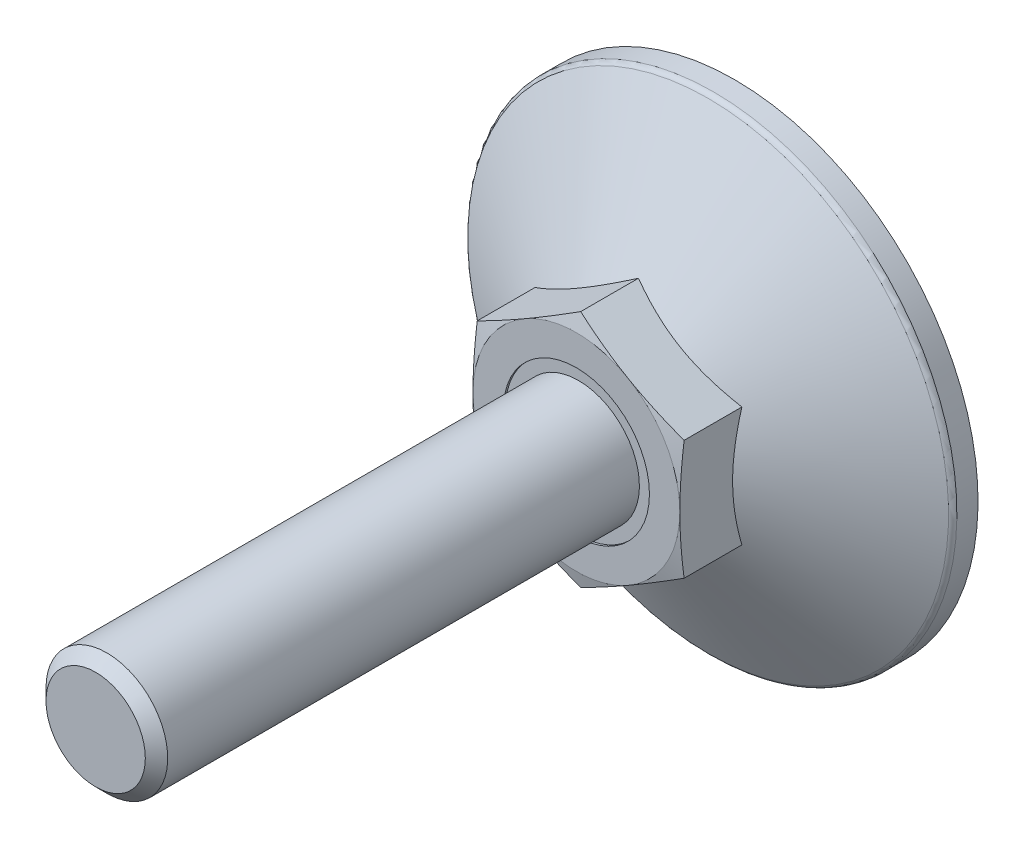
ISO-10303-21;
HEADER;
FILE_DESCRIPTION(('STEP AP214'),'2;1');
FILE_NAME('part.step','',(''),(''),'','','');
FILE_SCHEMA(('AUTOMOTIVE_DESIGN { 1 0 10303 214 1 1 1 1 }'));
ENDSEC;
DATA;
#1=APPLICATION_CONTEXT('core data for automotive mechanical design processes');
#2=APPLICATION_PROTOCOL_DEFINITION('international standard','automotive_design',2000,#1);
#3=PRODUCT_CONTEXT('',#1,'mechanical');
#4=PRODUCT('Part','Part','',(#3));
#5=PRODUCT_RELATED_PRODUCT_CATEGORY('part','',(#4));
#6=PRODUCT_DEFINITION_FORMATION('','',#4);
#7=PRODUCT_DEFINITION_CONTEXT('part definition',#1,'design');
#8=PRODUCT_DEFINITION('design','',#6,#7);
#9=PRODUCT_DEFINITION_SHAPE('','',#8);
#10=(LENGTH_UNIT() NAMED_UNIT(*) SI_UNIT(.MILLI.,.METRE.));
#11=(NAMED_UNIT(*) PLANE_ANGLE_UNIT() SI_UNIT($,.RADIAN.));
#12=(NAMED_UNIT(*) SI_UNIT($,.STERADIAN.) SOLID_ANGLE_UNIT());
#13=UNCERTAINTY_MEASURE_WITH_UNIT(LENGTH_MEASURE(1.E-05),#10,'distance_accuracy_value','');
#14=(GEOMETRIC_REPRESENTATION_CONTEXT(3) GLOBAL_UNCERTAINTY_ASSIGNED_CONTEXT((#13)) GLOBAL_UNIT_ASSIGNED_CONTEXT((#10,
#11,#12)) REPRESENTATION_CONTEXT('',''));
#15=CARTESIAN_POINT('',(0.,0.,0.));
#16=DIRECTION('',(0.,0.,1.));
#17=DIRECTION('',(1.,0.,0.));
#18=AXIS2_PLACEMENT_3D('',#15,#16,#17);
#19=CARTESIAN_POINT('',(0.,9.8149545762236,27.));
#20=DIRECTION('',(0.5,-0.86602540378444,0.));
#21=DIRECTION('',(0.86602540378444,0.5,0.));
#22=AXIS2_PLACEMENT_3D('',#19,#20,#21);
#23=PLANE('',#22);
#24=CARTESIAN_POINT('',(0.000200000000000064,9.81507004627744,12.6476280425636));
#25=CARTESIAN_POINT('',(-0.352800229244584,9.61126526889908,12.7022599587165));
#26=CARTESIAN_POINT('',(-0.706440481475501,9.40709097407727,12.7518566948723));
#27=CARTESIAN_POINT('',(-1.41496987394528,8.99802133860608,12.8389934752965));
#28=CARTESIAN_POINT('',(-1.76985946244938,8.79312573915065,12.8765286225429));
#29=CARTESIAN_POINT('',(-2.47873586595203,8.38385575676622,12.9373509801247));
#30=CARTESIAN_POINT('',(-2.83271788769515,8.17948414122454,12.9607107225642));
#31=CARTESIAN_POINT('',(-3.5411333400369,7.77048028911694,12.9920337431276));
#32=CARTESIAN_POINT('',(-3.89556667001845,7.56584811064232,13.));
#33=CARTESIAN_POINT('',(-4.60443332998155,7.15658375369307,13.));
#34=CARTESIAN_POINT('',(-4.9588666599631,6.95195157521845,12.9920337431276));
#35=CARTESIAN_POINT('',(-5.66728211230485,6.54294772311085,12.9607107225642));
#36=CARTESIAN_POINT('',(-6.02126413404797,6.33857610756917,12.9373509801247));
#37=CARTESIAN_POINT('',(-6.73014053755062,5.92930612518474,12.8765286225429));
#38=CARTESIAN_POINT('',(-7.08503012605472,5.7244105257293,12.8389934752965));
#39=CARTESIAN_POINT('',(-7.7935595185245,5.31534089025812,12.7518566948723));
#40=CARTESIAN_POINT('',(-8.14719977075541,5.11116659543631,12.7022599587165));
#41=CARTESIAN_POINT('',(-8.5002,4.90736181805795,12.6476280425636));
#42=B_SPLINE_CURVE_WITH_KNOTS('',3,(#24,#25,#26,#27,#28,#29,#30,#31,#32,#33,#34,#35,#36,#37,#38,
#39,#40,#41),.UNSPECIFIED.,.F.,.F.,(4,2,2,2,2,2,2,2,4),(0.,1.23382789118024,2.46815608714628,
3.69611406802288,4.92383440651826,6.15155474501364,7.37951272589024,8.61384092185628,
9.84766881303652),.UNSPECIFIED.);
#43=CARTESIAN_POINT('',(0.,9.8149545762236,12.6476589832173));
#44=VERTEX_POINT('',#43);
#45=CARTESIAN_POINT('',(-4.25,7.36121593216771,13.));
#46=VERTEX_POINT('',#45);
#47=EDGE_CURVE('E269',#44,#46,#42,.T.);
#48=ORIENTED_EDGE('',*,*,#47,.F.);
#49=DIRECTION('',(0.,0.,-1.));
#50=VECTOR('',#49,1.);
#51=CARTESIAN_POINT('',(0.,9.8149545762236,27.));
#52=LINE('',#51,#50);
#53=CARTESIAN_POINT('',(0.,9.8149545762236,7.90533871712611));
#54=VERTEX_POINT('',#53);
#55=EDGE_CURVE('E43',#44,#54,#52,.T.);
#56=ORIENTED_EDGE('',*,*,#55,.T.);
#57=CARTESIAN_POINT('',(-8.5002,4.90736181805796,7.90527204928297));
#58=CARTESIAN_POINT('',(-8.31336077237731,5.0152334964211,7.96754195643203));
#59=CARTESIAN_POINT('',(-8.1258249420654,5.12350735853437,8.02698579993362));
#60=CARTESIAN_POINT('',(-7.74923024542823,5.34093440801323,8.13944298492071));
#61=CARTESIAN_POINT('',(-7.56017075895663,5.45008795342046,8.19245355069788));
#62=CARTESIAN_POINT('',(-6.98996524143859,5.77929626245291,8.34079470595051));
#63=CARTESIAN_POINT('',(-6.60656835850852,6.00065055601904,8.42516916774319));
#64=CARTESIAN_POINT('',(-6.03282233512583,6.33190297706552,8.52410807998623));
#65=CARTESIAN_POINT('',(-5.8441872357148,6.44081150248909,8.55229289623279));
#66=CARTESIAN_POINT('',(-5.46606397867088,6.65912106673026,8.59955401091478));
#67=CARTESIAN_POINT('',(-5.27657589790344,6.76852206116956,8.61863111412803));
#68=CARTESIAN_POINT('',(-4.89727347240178,6.98751241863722,8.64719332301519));
#69=CARTESIAN_POINT('',(-4.70745974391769,7.0971014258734,8.65668931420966));
#70=CARTESIAN_POINT('',(-4.3276569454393,7.31638067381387,8.66588571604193));
#71=CARTESIAN_POINT('',(-4.13766788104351,7.42607091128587,8.66558642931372));
#72=CARTESIAN_POINT('',(-3.78247698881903,7.63114046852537,8.65587362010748));
#73=CARTESIAN_POINT('',(-3.61725009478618,7.7265342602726,8.64764492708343));
#74=CARTESIAN_POINT('',(-3.28718328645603,7.91709842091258,8.62393885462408));
#75=CARTESIAN_POINT('',(-3.12234339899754,8.01226877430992,8.60846098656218));
#76=CARTESIAN_POINT('',(-2.62846189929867,8.29741139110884,8.55151947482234));
#77=CARTESIAN_POINT('',(-2.30029449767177,8.48687892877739,8.49955503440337));
#78=CARTESIAN_POINT('',(-1.64047857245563,8.86782383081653,8.36964315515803));
#79=CARTESIAN_POINT('',(-1.30891425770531,9.0592525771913,8.29114502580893));
#80=CARTESIAN_POINT('',(-0.650730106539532,9.43925537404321,8.11298675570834));
#81=CARTESIAN_POINT('',(-0.324101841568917,9.62783429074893,8.01336845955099));
#82=CARTESIAN_POINT('',(0.000199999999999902,9.81507004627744,7.90527204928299));
#83=B_SPLINE_CURVE_WITH_KNOTS('',3,(#57,#58,#59,#60,#61,#62,#63,#64,#65,#66,#67,#68,#69,#70,#71,
#72,#73,#74,#75,#76,#77,#78,#79,#80,#81,#82),.UNSPECIFIED.,.F.,.F.,(4,2,2,2,2,2,2,2,2,2,2,2,4),
(0.,0.673596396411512,1.34748239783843,2.69805431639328,3.35679995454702,4.01548737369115,
4.67342558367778,5.33134346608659,5.90409556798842,6.47688628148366,7.62328361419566,
8.79510569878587,9.96462743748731),.UNSPECIFIED.);
#84=CARTESIAN_POINT('',(-8.5,4.9074772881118,7.90533871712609));
#85=VERTEX_POINT('',#84);
#86=EDGE_CURVE('E237',#85,#54,#83,.T.);
#87=ORIENTED_EDGE('',*,*,#86,.F.);
#88=DIRECTION('',(0.,0.,-1.));
#89=VECTOR('',#88,1.);
#90=CARTESIAN_POINT('',(-8.5,4.9074772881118,27.));
#91=LINE('',#90,#89);
#92=CARTESIAN_POINT('',(-8.5,4.9074772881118,12.6476589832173));
#93=VERTEX_POINT('',#92);
#94=EDGE_CURVE('E282',#93,#85,#91,.T.);
#95=ORIENTED_EDGE('',*,*,#94,.F.);
#96=EDGE_CURVE('E169',#46,#93,#42,.T.);
#97=ORIENTED_EDGE('',*,*,#96,.F.);
#98=EDGE_LOOP('',(#48,#56,#87,#95,#97));
#99=FACE_BOUND('',#98,.T.);
#100=ADVANCED_FACE('F14',(#99),#23,.F.);
#101=CARTESIAN_POINT('',(8.5,4.9074772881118,27.));
#102=DIRECTION('',(-0.5,-0.86602540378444,0.));
#103=DIRECTION('',(0.86602540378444,-0.5,0.));
#104=AXIS2_PLACEMENT_3D('',#101,#102,#103);
#105=PLANE('',#104);
#106=CARTESIAN_POINT('',(8.5002,4.90736181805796,12.6476280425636));
#107=CARTESIAN_POINT('',(8.14719977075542,5.11116659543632,12.7022599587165));
#108=CARTESIAN_POINT('',(7.7935595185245,5.31534089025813,12.7518566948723));
#109=CARTESIAN_POINT('',(7.08503012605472,5.72441052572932,12.8389934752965));
#110=CARTESIAN_POINT('',(6.73014053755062,5.92930612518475,12.8765286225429));
#111=CARTESIAN_POINT('',(6.02126413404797,6.33857610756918,12.9373509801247));
#112=CARTESIAN_POINT('',(5.66728211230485,6.54294772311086,12.9607107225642));
#113=CARTESIAN_POINT('',(4.9588666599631,6.95195157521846,12.9920337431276));
#114=CARTESIAN_POINT('',(4.60443332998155,7.15658375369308,13.));
#115=CARTESIAN_POINT('',(3.89556667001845,7.56584811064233,13.));
#116=CARTESIAN_POINT('',(3.5411333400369,7.77048028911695,12.9920337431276));
#117=CARTESIAN_POINT('',(2.83271788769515,8.17948414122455,12.9607107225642));
#118=CARTESIAN_POINT('',(2.47873586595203,8.38385575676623,12.9373509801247));
#119=CARTESIAN_POINT('',(1.76985946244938,8.79312573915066,12.8765286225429));
#120=CARTESIAN_POINT('',(1.41496987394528,8.9980213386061,12.8389934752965));
#121=CARTESIAN_POINT('',(0.706440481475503,9.40709097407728,12.7518566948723));
#122=CARTESIAN_POINT('',(0.352800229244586,9.61126526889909,12.7022599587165));
#123=CARTESIAN_POINT('',(-0.000200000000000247,9.81507004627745,12.6476280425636));
#124=B_SPLINE_CURVE_WITH_KNOTS('',3,(#106,#107,#108,#109,#110,#111,#112,#113,#114,#115,#116,
#117,#118,#119,#120,#121,#122,#123),.UNSPECIFIED.,.F.,.F.,(4,2,2,2,2,2,2,2,4),(0.,
1.23382789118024,2.46815608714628,3.69611406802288,4.92383440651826,6.15155474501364,
7.37951272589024,8.61384092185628,9.84766881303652),.UNSPECIFIED.);
#125=CARTESIAN_POINT('',(8.5,4.9074772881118,12.6476589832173));
#126=VERTEX_POINT('',#125);
#127=CARTESIAN_POINT('',(4.25,7.36121593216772,13.));
#128=VERTEX_POINT('',#127);
#129=EDGE_CURVE('E121',#126,#128,#124,.T.);
#130=ORIENTED_EDGE('',*,*,#129,.F.);
#131=DIRECTION('',(0.,0.,-1.));
#132=VECTOR('',#131,1.);
#133=CARTESIAN_POINT('',(8.5,4.9074772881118,27.));
#134=LINE('',#133,#132);
#135=CARTESIAN_POINT('',(8.5,4.9074772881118,7.90533871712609));
#136=VERTEX_POINT('',#135);
#137=EDGE_CURVE('E128',#126,#136,#134,.T.);
#138=ORIENTED_EDGE('',*,*,#137,.T.);
#139=CARTESIAN_POINT('',(-0.0002,9.81507004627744,7.90527204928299));
#140=CARTESIAN_POINT('',(0.186639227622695,9.7071983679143,7.96754195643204));
#141=CARTESIAN_POINT('',(0.374175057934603,9.59892450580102,8.02698579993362));
#142=CARTESIAN_POINT('',(0.750769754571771,9.38149745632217,8.13944298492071));
#143=CARTESIAN_POINT('',(0.939829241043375,9.27234391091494,8.19245355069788));
#144=CARTESIAN_POINT('',(1.51003475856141,8.94313560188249,8.34079470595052));
#145=CARTESIAN_POINT('',(1.89343164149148,8.72178130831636,8.42516916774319));
#146=CARTESIAN_POINT('',(2.46717766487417,8.39052888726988,8.52410807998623));
#147=CARTESIAN_POINT('',(2.6558127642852,8.28162036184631,8.55229289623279));
#148=CARTESIAN_POINT('',(3.03393602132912,8.06331079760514,8.59955401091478));
#149=CARTESIAN_POINT('',(3.22342410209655,7.95390980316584,8.61863111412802));
#150=CARTESIAN_POINT('',(3.60272652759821,7.73491944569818,8.64719332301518));
#151=CARTESIAN_POINT('',(3.79254025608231,7.62533043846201,8.65668931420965));
#152=CARTESIAN_POINT('',(4.1723430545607,7.40605119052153,8.66588571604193));
#153=CARTESIAN_POINT('',(4.36233211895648,7.29636095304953,8.66558642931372));
#154=CARTESIAN_POINT('',(4.71752301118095,7.09129139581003,8.65587362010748));
#155=CARTESIAN_POINT('',(4.88274990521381,6.9958976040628,8.64764492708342));
#156=CARTESIAN_POINT('',(5.21281671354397,6.80533344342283,8.62393885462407));
#157=CARTESIAN_POINT('',(5.37765660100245,6.71016309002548,8.60846098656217));
#158=CARTESIAN_POINT('',(5.87153810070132,6.42502047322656,8.55151947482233));
#159=CARTESIAN_POINT('',(6.19970550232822,6.23555293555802,8.49955503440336));
#160=CARTESIAN_POINT('',(6.85952142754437,5.85460803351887,8.36964315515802));
#161=CARTESIAN_POINT('',(7.19108574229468,5.6631792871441,8.29114502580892));
#162=CARTESIAN_POINT('',(7.84926989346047,5.28317649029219,8.11298675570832));
#163=CARTESIAN_POINT('',(8.17589815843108,5.09459757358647,8.01336845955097));
#164=CARTESIAN_POINT('',(8.5002,4.90736181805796,7.90527204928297));
#165=B_SPLINE_CURVE_WITH_KNOTS('',3,(#139,#140,#141,#142,#143,#144,#145,#146,#147,#148,#149,
#150,#151,#152,#153,#154,#155,#156,#157,#158,#159,#160,#161,#162,#163,#164),.UNSPECIFIED.,.F.,
.F.,(4,2,2,2,2,2,2,2,2,2,2,2,4),(0.,0.673596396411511,1.34748239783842,2.69805431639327,
3.35679995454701,4.01548737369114,4.67342558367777,5.33134346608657,5.90409556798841,
6.47688628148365,7.62328361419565,8.79510569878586,9.96462743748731),.UNSPECIFIED.);
#166=EDGE_CURVE('E231',#54,#136,#165,.T.);
#167=ORIENTED_EDGE('',*,*,#166,.F.);
#168=ORIENTED_EDGE('',*,*,#55,.F.);
#169=EDGE_CURVE('E138',#128,#44,#124,.T.);
#170=ORIENTED_EDGE('',*,*,#169,.F.);
#171=EDGE_LOOP('',(#130,#138,#167,#168,#170));
#172=FACE_BOUND('',#171,.T.);
#173=ADVANCED_FACE('F243',(#172),#105,.F.);
#174=CARTESIAN_POINT('',(8.5,-4.9074772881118,27.));
#175=DIRECTION('',(-1.,0.,0.));
#176=DIRECTION('',(0.,-1.,0.));
#177=AXIS2_PLACEMENT_3D('',#174,#175,#176);
#178=PLANE('',#177);
#179=CARTESIAN_POINT('',(8.5,-12.9859611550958,11.1188690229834));
#180=CARTESIAN_POINT('',(8.5,-12.6002965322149,11.2053090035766));
#181=CARTESIAN_POINT('',(8.5,-12.2143907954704,11.2906924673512));
#182=CARTESIAN_POINT('',(8.5,-11.4419786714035,11.4587760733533));
#183=CARTESIAN_POINT('',(8.5,-11.055472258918,11.5414760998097));
#184=CARTESIAN_POINT('',(8.5,-10.2813946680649,11.7036944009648));
#185=CARTESIAN_POINT('',(8.5,-9.89382281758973,11.7832094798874));
#186=CARTESIAN_POINT('',(8.5,-9.11787270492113,11.9382002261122));
#187=CARTESIAN_POINT('',(8.5,-8.72949444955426,12.0136759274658));
#188=CARTESIAN_POINT('',(8.5,-7.95488762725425,12.159044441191));
#189=CARTESIAN_POINT('',(8.5,-7.5686665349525,12.228976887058));
#190=CARTESIAN_POINT('',(8.5,-6.79517107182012,12.3627405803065));
#191=CARTESIAN_POINT('',(8.5,-6.40789672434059,12.4265719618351));
#192=CARTESIAN_POINT('',(8.5,-5.63221911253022,12.5466971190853));
#193=CARTESIAN_POINT('',(8.5,-5.24381599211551,12.6029918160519));
#194=CARTESIAN_POINT('',(8.5,-4.46577364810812,12.7063853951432));
#195=CARTESIAN_POINT('',(8.5,-4.07613442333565,12.7534842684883));
#196=CARTESIAN_POINT('',(8.5,-3.29122243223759,12.8371533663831));
#197=CARTESIAN_POINT('',(8.5,-2.89593603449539,12.8735976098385));
#198=CARTESIAN_POINT('',(8.5,-2.10436864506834,12.9334438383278));
#199=CARTESIAN_POINT('',(8.5,-1.70808767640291,12.9568461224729));
#200=CARTESIAN_POINT('',(8.5,-0.915106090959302,12.9892435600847));
#201=CARTESIAN_POINT('',(8.5,-0.518405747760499,12.9982452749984));
#202=CARTESIAN_POINT('',(8.5,0.275053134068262,13.0012880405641));
#203=CARTESIAN_POINT('',(8.5,0.671811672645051,12.9953291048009));
#204=CARTESIAN_POINT('',(8.5,1.46627319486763,12.9687856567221));
#205=CARTESIAN_POINT('',(8.5,1.86397436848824,12.9481480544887));
#206=CARTESIAN_POINT('',(8.5,2.65844192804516,12.8934256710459));
#207=CARTESIAN_POINT('',(8.5,3.05520829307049,12.859340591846));
#208=CARTESIAN_POINT('',(8.5,3.84780279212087,12.7794459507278));
#209=CARTESIAN_POINT('',(8.5,4.24363014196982,12.7336287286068));
#210=CARTESIAN_POINT('',(8.5,5.03401082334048,12.6321775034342));
#211=CARTESIAN_POINT('',(8.5,5.42856415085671,12.5765434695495));
#212=CARTESIAN_POINT('',(8.5,6.19058167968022,12.4611545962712));
#213=CARTESIAN_POINT('',(8.5,6.55812393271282,12.4019099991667));
#214=CARTESIAN_POINT('',(8.5,7.29223900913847,12.2776646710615));
#215=CARTESIAN_POINT('',(8.5,7.65881180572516,12.212663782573));
#216=CARTESIAN_POINT('',(8.5,8.3911218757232,12.0779580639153));
#217=CARTESIAN_POINT('',(8.5,8.75685907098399,12.0082528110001));
#218=CARTESIAN_POINT('',(8.5,9.48758315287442,11.8650038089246));
#219=CARTESIAN_POINT('',(8.5,9.8525700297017,11.7914600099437));
#220=CARTESIAN_POINT('',(8.5,10.5819772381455,11.641212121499));
#221=CARTESIAN_POINT('',(8.5,10.9463974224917,11.5645073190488));
#222=CARTESIAN_POINT('',(8.5,11.6746829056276,11.4085034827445));
#223=CARTESIAN_POINT('',(8.5,12.0385482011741,11.329204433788));
#224=CARTESIAN_POINT('',(8.5,13.1293867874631,11.0881164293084));
#225=CARTESIAN_POINT('',(8.5,13.8556523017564,10.9231262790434));
#226=CARTESIAN_POINT('',(8.5,15.2996651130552,10.5888438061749));
#227=CARTESIAN_POINT('',(8.5,16.017425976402,10.4196097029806));
#228=CARTESIAN_POINT('',(8.5,17.451946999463,10.0769018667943));
#229=CARTESIAN_POINT('',(8.5,18.1687071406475,9.90342805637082));
#230=CARTESIAN_POINT('',(8.5,19.6005754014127,9.55356866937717));
#231=CARTESIAN_POINT('',(8.5,20.3156844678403,9.37718695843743));
#232=CARTESIAN_POINT('',(8.5,21.7452798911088,9.02201632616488));
#233=CARTESIAN_POINT('',(8.5,22.4597662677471,8.84322748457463));
#234=CARTESIAN_POINT('',(8.5,23.1740357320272,8.66358584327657));
#235=B_SPLINE_CURVE_WITH_KNOTS('',3,(#179,#180,#181,#182,#183,#184,#185,#186,#187,#188,#189,
#190,#191,#192,#193,#194,#195,#196,#197,#198,#199,#200,#201,#202,#203,#204,#205,#206,#207,#208,
#209,#210,#211,#212,#213,#214,#215,#216,#217,#218,#219,#220,#221,#222,#223,#224,#225,#226,#227,
#228,#229,#230,#231,#232,#233,#234),.UNSPECIFIED.,.F.,.F.,(4,2,2,2,2,2,2,2,2,2,2,2,2,2,2,2,2,2,
2,2,2,2,2,2,2,2,2,4),(0.,1.18570362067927,2.37145832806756,3.55837444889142,4.74528056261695,
5.92274541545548,7.10018437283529,8.27747927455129,9.4547753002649,10.6454756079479,
11.8361486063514,13.02627893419,14.216408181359,15.4108639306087,16.6053461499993,
17.8006102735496,18.9958781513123,20.1126836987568,21.2295198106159,22.3464564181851,
23.4634075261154,24.5806119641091,25.6978229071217,27.932093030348,30.1444043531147,
32.356756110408,34.5663722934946,36.775915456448),.UNSPECIFIED.);
#236=CARTESIAN_POINT('',(8.5,-4.90747728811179,12.6476589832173));
#237=VERTEX_POINT('',#236);
#238=CARTESIAN_POINT('',(8.5,0.,13.));
#239=VERTEX_POINT('',#238);
#240=EDGE_CURVE('E95',#237,#239,#235,.T.);
#241=ORIENTED_EDGE('',*,*,#240,.F.);
#242=DIRECTION('',(0.,0.,-1.));
#243=VECTOR('',#242,1.);
#244=CARTESIAN_POINT('',(8.5,-4.9074772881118,27.));
#245=LINE('',#244,#243);
#246=CARTESIAN_POINT('',(8.5,-4.9074772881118,7.90533871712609));
#247=VERTEX_POINT('',#246);
#248=EDGE_CURVE('E275',#237,#247,#245,.T.);
#249=ORIENTED_EDGE('',*,*,#248,.T.);
#250=CARTESIAN_POINT('',(8.5,12.7492767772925,4.72527230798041));
#251=CARTESIAN_POINT('',(8.5,12.3811478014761,4.90206026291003));
#252=CARTESIAN_POINT('',(8.5,12.0121249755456,5.07702151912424));
#253=CARTESIAN_POINT('',(8.5,11.2718137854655,5.42225230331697));
#254=CARTESIAN_POINT('',(8.5,10.9005250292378,5.59252098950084));
#255=CARTESIAN_POINT('',(8.5,10.1530767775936,5.92827896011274));
#256=CARTESIAN_POINT('',(8.5,9.77690140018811,6.09373302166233));
#257=CARTESIAN_POINT('',(8.5,9.02139912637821,6.41725455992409));
#258=CARTESIAN_POINT('',(8.5,8.64207239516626,6.57532242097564));
#259=CARTESIAN_POINT('',(8.5,7.86979942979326,6.88607334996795));
#260=CARTESIAN_POINT('',(8.5,7.47675434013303,7.03851219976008));
#261=CARTESIAN_POINT('',(8.5,6.68591204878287,7.33076935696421));
#262=CARTESIAN_POINT('',(8.5,6.28811429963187,7.47058619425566));
#263=CARTESIAN_POINT('',(8.5,5.48802263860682,7.733611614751));
#264=CARTESIAN_POINT('',(8.5,5.08574124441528,7.85685783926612));
#265=CARTESIAN_POINT('',(8.5,4.27544970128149,8.08251258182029));
#266=CARTESIAN_POINT('',(8.5,3.86744153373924,8.18492812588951));
#267=CARTESIAN_POINT('',(8.5,3.04728386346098,8.36327495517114));
#268=CARTESIAN_POINT('',(8.5,2.6351585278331,8.43931422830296));
#269=CARTESIAN_POINT('',(8.5,2.01359122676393,8.53003978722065));
#270=CARTESIAN_POINT('',(8.5,1.80582110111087,8.55639399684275));
#271=CARTESIAN_POINT('',(8.5,1.38940213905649,8.60080126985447));
#272=CARTESIAN_POINT('',(8.5,1.18075338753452,8.61885511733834));
#273=CARTESIAN_POINT('',(8.5,0.765376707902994,8.64609671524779));
#274=CARTESIAN_POINT('',(8.5,0.558655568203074,8.65538769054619));
#275=CARTESIAN_POINT('',(8.5,0.1450067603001,8.66526416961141));
#276=CARTESIAN_POINT('',(8.5,-0.0619209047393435,8.6658498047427));
#277=CARTESIAN_POINT('',(8.5,-0.475626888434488,8.65830085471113));
#278=CARTESIAN_POINT('',(8.5,-0.682405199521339,8.65016585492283));
#279=CARTESIAN_POINT('',(8.5,-1.09545270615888,8.625363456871));
#280=CARTESIAN_POINT('',(8.5,-1.30172187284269,8.60869558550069));
#281=CARTESIAN_POINT('',(8.5,-1.81090940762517,8.55735076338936));
#282=CARTESIAN_POINT('',(8.5,-2.11335210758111,8.51788364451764));
#283=CARTESIAN_POINT('',(8.5,-2.71570235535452,8.4228634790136));
#284=CARTESIAN_POINT('',(8.5,-3.01560949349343,8.36730788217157));
#285=CARTESIAN_POINT('',(8.5,-3.61268959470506,8.2420877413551));
#286=CARTESIAN_POINT('',(8.5,-3.90986014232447,8.17241178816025));
#287=CARTESIAN_POINT('',(8.5,-4.50108875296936,8.02104250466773));
#288=CARTESIAN_POINT('',(8.5,-4.79514688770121,7.93934945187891));
#289=CARTESIAN_POINT('',(8.5,-5.3871494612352,7.7638116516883));
#290=CARTESIAN_POINT('',(8.5,-5.68502188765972,7.6697256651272));
#291=CARTESIAN_POINT('',(8.5,-6.27782977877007,7.4727599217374));
#292=CARTESIAN_POINT('',(8.5,-6.57276522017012,7.36988009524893));
#293=CARTESIAN_POINT('',(8.5,-7.15987047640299,7.15687683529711));
#294=CARTESIAN_POINT('',(8.5,-7.45204129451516,7.04675615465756));
#295=CARTESIAN_POINT('',(8.5,-8.03401937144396,6.82048197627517));
#296=CARTESIAN_POINT('',(8.5,-8.32382669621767,6.70432864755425));
#297=CARTESIAN_POINT('',(8.5,-8.8985343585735,6.468166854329));
#298=CARTESIAN_POINT('',(8.5,-9.18345493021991,6.34820749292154));
#299=CARTESIAN_POINT('',(8.5,-9.75152375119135,6.10415692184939));
#300=CARTESIAN_POINT('',(8.5,-10.034671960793,5.98006561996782));
#301=CARTESIAN_POINT('',(8.5,-10.8818575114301,5.60257794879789));
#302=CARTESIAN_POINT('',(8.5,-11.4435817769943,5.34399030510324));
#303=CARTESIAN_POINT('',(8.5,-12.5625477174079,4.81675169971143));
#304=CARTESIAN_POINT('',(8.5,-13.1197873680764,4.54809647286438));
#305=CARTESIAN_POINT('',(8.5,-14.2306052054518,4.00340707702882));
#306=CARTESIAN_POINT('',(8.5,-14.7841835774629,3.72737328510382));
#307=CARTESIAN_POINT('',(8.5,-15.8894273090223,3.16924748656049));
#308=CARTESIAN_POINT('',(8.5,-16.4410879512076,2.88714616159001));
#309=CARTESIAN_POINT('',(8.5,-17.5421722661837,2.31860293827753));
#310=CARTESIAN_POINT('',(8.5,-18.0915959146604,2.03216099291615));
#311=CARTESIAN_POINT('',(8.5,-19.1885131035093,1.45593769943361));
#312=CARTESIAN_POINT('',(8.5,-19.7360070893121,1.1661571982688));
#313=CARTESIAN_POINT('',(8.5,-20.8295421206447,0.583866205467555));
#314=CARTESIAN_POINT('',(8.5,-21.3755831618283,0.291355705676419));
#315=CARTESIAN_POINT('',(8.5,-22.8810608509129,-0.519031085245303));
#316=CARTESIAN_POINT('',(8.5,-23.8392547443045,-1.03921546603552));
#317=CARTESIAN_POINT('',(8.5,-25.7530641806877,-2.08445783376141));
#318=CARTESIAN_POINT('',(8.5,-26.708679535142,-2.60951616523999));
#319=CARTESIAN_POINT('',(8.5,-28.6148788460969,-3.66152013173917));
#320=CARTESIAN_POINT('',(8.5,-29.565469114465,-4.18845433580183));
#321=CARTESIAN_POINT('',(8.5,-30.9901906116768,-4.98085413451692));
#322=CARTESIAN_POINT('',(8.5,-31.4648842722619,-5.24530955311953));
#323=CARTESIAN_POINT('',(8.5,-32.4139385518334,-5.77481644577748));
#324=CARTESIAN_POINT('',(8.5,-32.8882991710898,-6.03986791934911));
#325=CARTESIAN_POINT('',(8.5,-33.3625145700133,-6.30517901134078));
#326=B_SPLINE_CURVE_WITH_KNOTS('',3,(#250,#251,#252,#253,#254,#255,#256,#257,#258,#259,#260,
#261,#262,#263,#264,#265,#266,#267,#268,#269,#270,#271,#272,#273,#274,#275,#276,#277,#278,#279,
#280,#281,#282,#283,#284,#285,#286,#287,#288,#289,#290,#291,#292,#293,#294,#295,#296,#297,#298,
#299,#300,#301,#302,#303,#304,#305,#306,#307,#308,#309,#310,#311,#312,#313,#314,#315,#316,#317,
#318,#319,#320,#321,#322,#323,#324,#325),.UNSPECIFIED.,.F.,.F.,(4,2,2,2,2,2,2,2,2,2,2,2,2,2,2,2,
2,2,2,2,2,2,2,2,2,2,2,2,2,2,2,2,2,2,2,2,2,4),(0.,1.22515253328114,2.45052343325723,
3.6833213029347,4.91605495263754,6.18059988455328,7.44529191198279,8.70706073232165,
9.96840325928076,11.2245189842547,11.852683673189,12.4807890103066,13.1013994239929,
13.7220004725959,14.3426310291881,14.9632960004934,15.8778021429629,16.7924533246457,
17.7078465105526,18.6232185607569,19.5601888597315,20.4971665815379,21.433790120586,
22.3703874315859,23.297780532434,24.225194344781,26.0801973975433,27.9359954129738,
29.7916987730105,31.6504906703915,33.5093027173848,35.3676531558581,37.2260091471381,
40.4968499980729,43.7679238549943,47.0285209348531,48.6586852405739,50.2888482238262),.UNSPECIFIED.);
#327=EDGE_CURVE('E197',#136,#247,#326,.T.);
#328=ORIENTED_EDGE('',*,*,#327,.F.);
#329=ORIENTED_EDGE('',*,*,#137,.F.);
#330=EDGE_CURVE('E106',#239,#126,#235,.T.);
#331=ORIENTED_EDGE('',*,*,#330,.F.);
#332=EDGE_LOOP('',(#241,#249,#328,#329,#331));
#333=FACE_BOUND('',#332,.T.);
#334=ADVANCED_FACE('F126',(#333),#178,.F.);
#335=CARTESIAN_POINT('',(0.,-9.8149545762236,27.));
#336=DIRECTION('',(-0.5,0.86602540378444,0.));
#337=DIRECTION('',(-0.86602540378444,-0.5,0.));
#338=AXIS2_PLACEMENT_3D('',#335,#336,#337);
#339=PLANE('',#338);
#340=CARTESIAN_POINT('',(-0.000200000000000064,-9.81507004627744,12.6476280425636));
#341=CARTESIAN_POINT('',(0.352800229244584,-9.61126526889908,12.7022599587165));
#342=CARTESIAN_POINT('',(0.706440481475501,-9.40709097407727,12.7518566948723));
#343=CARTESIAN_POINT('',(1.41496987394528,-8.99802133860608,12.8389934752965));
#344=CARTESIAN_POINT('',(1.76985946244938,-8.79312573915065,12.8765286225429));
#345=CARTESIAN_POINT('',(2.47873586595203,-8.38385575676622,12.9373509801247));
#346=CARTESIAN_POINT('',(2.83271788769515,-8.17948414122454,12.9607107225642));
#347=CARTESIAN_POINT('',(3.5411333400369,-7.77048028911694,12.9920337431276));
#348=CARTESIAN_POINT('',(3.89556667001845,-7.56584811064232,13.));
#349=CARTESIAN_POINT('',(4.60443332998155,-7.15658375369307,13.));
#350=CARTESIAN_POINT('',(4.9588666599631,-6.95195157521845,12.9920337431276));
#351=CARTESIAN_POINT('',(5.66728211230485,-6.54294772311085,12.9607107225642));
#352=CARTESIAN_POINT('',(6.02126413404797,-6.33857610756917,12.9373509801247));
#353=CARTESIAN_POINT('',(6.73014053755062,-5.92930612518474,12.8765286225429));
#354=CARTESIAN_POINT('',(7.08503012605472,-5.7244105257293,12.8389934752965));
#355=CARTESIAN_POINT('',(7.7935595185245,-5.31534089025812,12.7518566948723));
#356=CARTESIAN_POINT('',(8.14719977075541,-5.11116659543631,12.7022599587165));
#357=CARTESIAN_POINT('',(8.5002,-4.90736181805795,12.6476280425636));
#358=B_SPLINE_CURVE_WITH_KNOTS('',3,(#340,#341,#342,#343,#344,#345,#346,#347,#348,#349,#350,
#351,#352,#353,#354,#355,#356,#357),.UNSPECIFIED.,.F.,.F.,(4,2,2,2,2,2,2,2,4),(0.,
1.23382789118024,2.46815608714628,3.69611406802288,4.92383440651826,6.15155474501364,
7.37951272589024,8.61384092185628,9.84766881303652),.UNSPECIFIED.);
#359=CARTESIAN_POINT('',(0.,-9.81495457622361,12.6476589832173));
#360=VERTEX_POINT('',#359);
#361=CARTESIAN_POINT('',(4.25,-7.36121593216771,13.));
#362=VERTEX_POINT('',#361);
#363=EDGE_CURVE('E130',#360,#362,#358,.T.);
#364=ORIENTED_EDGE('',*,*,#363,.F.);
#365=DIRECTION('',(0.,0.,-1.));
#366=VECTOR('',#365,1.);
#367=CARTESIAN_POINT('',(0.,-9.8149545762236,27.));
#368=LINE('',#367,#366);
#369=CARTESIAN_POINT('',(0.,-9.8149545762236,7.90533871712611));
#370=VERTEX_POINT('',#369);
#371=EDGE_CURVE('E279',#360,#370,#368,.T.);
#372=ORIENTED_EDGE('',*,*,#371,.T.);
#373=CARTESIAN_POINT('',(8.5002,-4.90736181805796,7.90527204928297));
#374=CARTESIAN_POINT('',(8.31336077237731,-5.0152334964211,7.96754195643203));
#375=CARTESIAN_POINT('',(8.1258249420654,-5.12350735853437,8.02698579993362));
#376=CARTESIAN_POINT('',(7.74923024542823,-5.34093440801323,8.13944298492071));
#377=CARTESIAN_POINT('',(7.56017075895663,-5.45008795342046,8.19245355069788));
#378=CARTESIAN_POINT('',(6.98996524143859,-5.77929626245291,8.34079470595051));
#379=CARTESIAN_POINT('',(6.60656835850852,-6.00065055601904,8.42516916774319));
#380=CARTESIAN_POINT('',(6.03282233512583,-6.33190297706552,8.52410807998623));
#381=CARTESIAN_POINT('',(5.8441872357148,-6.44081150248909,8.55229289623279));
#382=CARTESIAN_POINT('',(5.46606397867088,-6.65912106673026,8.59955401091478));
#383=CARTESIAN_POINT('',(5.27657589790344,-6.76852206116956,8.61863111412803));
#384=CARTESIAN_POINT('',(4.89727347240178,-6.98751241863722,8.64719332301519));
#385=CARTESIAN_POINT('',(4.70745974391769,-7.0971014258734,8.65668931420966));
#386=CARTESIAN_POINT('',(4.3276569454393,-7.31638067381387,8.66588571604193));
#387=CARTESIAN_POINT('',(4.13766788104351,-7.42607091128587,8.66558642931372));
#388=CARTESIAN_POINT('',(3.78247698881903,-7.63114046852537,8.65587362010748));
#389=CARTESIAN_POINT('',(3.61725009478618,-7.7265342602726,8.64764492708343));
#390=CARTESIAN_POINT('',(3.28718328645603,-7.91709842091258,8.62393885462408));
#391=CARTESIAN_POINT('',(3.12234339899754,-8.01226877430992,8.60846098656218));
#392=CARTESIAN_POINT('',(2.62846189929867,-8.29741139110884,8.55151947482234));
#393=CARTESIAN_POINT('',(2.30029449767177,-8.48687892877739,8.49955503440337));
#394=CARTESIAN_POINT('',(1.64047857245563,-8.86782383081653,8.36964315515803));
#395=CARTESIAN_POINT('',(1.30891425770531,-9.0592525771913,8.29114502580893));
#396=CARTESIAN_POINT('',(0.650730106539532,-9.43925537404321,8.11298675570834));
#397=CARTESIAN_POINT('',(0.324101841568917,-9.62783429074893,8.01336845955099));
#398=CARTESIAN_POINT('',(-0.000199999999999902,-9.81507004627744,7.90527204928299));
#399=B_SPLINE_CURVE_WITH_KNOTS('',3,(#373,#374,#375,#376,#377,#378,#379,#380,#381,#382,#383,
#384,#385,#386,#387,#388,#389,#390,#391,#392,#393,#394,#395,#396,#397,#398),.UNSPECIFIED.,.F.,
.F.,(4,2,2,2,2,2,2,2,2,2,2,2,4),(0.,0.673596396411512,1.34748239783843,2.69805431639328,
3.35679995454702,4.01548737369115,4.67342558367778,5.33134346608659,5.90409556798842,
6.47688628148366,7.62328361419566,8.79510569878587,9.96462743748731),.UNSPECIFIED.);
#400=EDGE_CURVE('E188',#247,#370,#399,.T.);
#401=ORIENTED_EDGE('',*,*,#400,.F.);
#402=ORIENTED_EDGE('',*,*,#248,.F.);
#403=EDGE_CURVE('E101',#362,#237,#358,.T.);
#404=ORIENTED_EDGE('',*,*,#403,.F.);
#405=EDGE_LOOP('',(#364,#372,#401,#402,#404));
#406=FACE_BOUND('',#405,.T.);
#407=ADVANCED_FACE('F180',(#406),#339,.F.);
#408=CARTESIAN_POINT('',(-8.5,-4.9074772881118,27.));
#409=DIRECTION('',(0.5,0.86602540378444,0.));
#410=DIRECTION('',(-0.86602540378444,0.5,0.));
#411=AXIS2_PLACEMENT_3D('',#408,#409,#410);
#412=PLANE('',#411);
#413=CARTESIAN_POINT('',(-8.5002,-4.90736181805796,12.6476280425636));
#414=CARTESIAN_POINT('',(-8.14719977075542,-5.11116659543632,12.7022599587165));
#415=CARTESIAN_POINT('',(-7.7935595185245,-5.31534089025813,12.7518566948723));
#416=CARTESIAN_POINT('',(-7.08503012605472,-5.72441052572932,12.8389934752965));
#417=CARTESIAN_POINT('',(-6.73014053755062,-5.92930612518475,12.8765286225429));
#418=CARTESIAN_POINT('',(-6.02126413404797,-6.33857610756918,12.9373509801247));
#419=CARTESIAN_POINT('',(-5.66728211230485,-6.54294772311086,12.9607107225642));
#420=CARTESIAN_POINT('',(-4.9588666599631,-6.95195157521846,12.9920337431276));
#421=CARTESIAN_POINT('',(-4.60443332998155,-7.15658375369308,13.));
#422=CARTESIAN_POINT('',(-3.89556667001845,-7.56584811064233,13.));
#423=CARTESIAN_POINT('',(-3.5411333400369,-7.77048028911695,12.9920337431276));
#424=CARTESIAN_POINT('',(-2.83271788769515,-8.17948414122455,12.9607107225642));
#425=CARTESIAN_POINT('',(-2.47873586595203,-8.38385575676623,12.9373509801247));
#426=CARTESIAN_POINT('',(-1.76985946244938,-8.79312573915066,12.8765286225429));
#427=CARTESIAN_POINT('',(-1.41496987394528,-8.9980213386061,12.8389934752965));
#428=CARTESIAN_POINT('',(-0.706440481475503,-9.40709097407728,12.7518566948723));
#429=CARTESIAN_POINT('',(-0.352800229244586,-9.61126526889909,12.7022599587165));
#430=CARTESIAN_POINT('',(0.000200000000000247,-9.81507004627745,12.6476280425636));
#431=B_SPLINE_CURVE_WITH_KNOTS('',3,(#413,#414,#415,#416,#417,#418,#419,#420,#421,#422,#423,
#424,#425,#426,#427,#428,#429,#430),.UNSPECIFIED.,.F.,.F.,(4,2,2,2,2,2,2,2,4),(0.,
1.23382789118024,2.46815608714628,3.69611406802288,4.92383440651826,6.15155474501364,
7.37951272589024,8.61384092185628,9.84766881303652),.UNSPECIFIED.);
#432=CARTESIAN_POINT('',(-8.5,-4.9074772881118,12.6476589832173));
#433=VERTEX_POINT('',#432);
#434=CARTESIAN_POINT('',(-4.25,-7.36121593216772,13.));
#435=VERTEX_POINT('',#434);
#436=EDGE_CURVE('E161',#433,#435,#431,.T.);
#437=ORIENTED_EDGE('',*,*,#436,.F.);
#438=DIRECTION('',(0.,0.,-1.));
#439=VECTOR('',#438,1.);
#440=CARTESIAN_POINT('',(-8.5,-4.9074772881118,27.));
#441=LINE('',#440,#439);
#442=CARTESIAN_POINT('',(-8.5,-4.9074772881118,7.90533871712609));
#443=VERTEX_POINT('',#442);
#444=EDGE_CURVE('E281',#433,#443,#441,.T.);
#445=ORIENTED_EDGE('',*,*,#444,.T.);
#446=CARTESIAN_POINT('',(0.0002,-9.81507004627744,7.90527204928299));
#447=CARTESIAN_POINT('',(-0.186639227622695,-9.7071983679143,7.96754195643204));
#448=CARTESIAN_POINT('',(-0.374175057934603,-9.59892450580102,8.02698579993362));
#449=CARTESIAN_POINT('',(-0.750769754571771,-9.38149745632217,8.13944298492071));
#450=CARTESIAN_POINT('',(-0.939829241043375,-9.27234391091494,8.19245355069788));
#451=CARTESIAN_POINT('',(-1.51003475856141,-8.94313560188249,8.34079470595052));
#452=CARTESIAN_POINT('',(-1.89343164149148,-8.72178130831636,8.42516916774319));
#453=CARTESIAN_POINT('',(-2.46717766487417,-8.39052888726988,8.52410807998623));
#454=CARTESIAN_POINT('',(-2.6558127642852,-8.28162036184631,8.55229289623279));
#455=CARTESIAN_POINT('',(-3.03393602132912,-8.06331079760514,8.59955401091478));
#456=CARTESIAN_POINT('',(-3.22342410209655,-7.95390980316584,8.61863111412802));
#457=CARTESIAN_POINT('',(-3.60272652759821,-7.73491944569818,8.64719332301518));
#458=CARTESIAN_POINT('',(-3.79254025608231,-7.62533043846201,8.65668931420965));
#459=CARTESIAN_POINT('',(-4.1723430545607,-7.40605119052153,8.66588571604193));
#460=CARTESIAN_POINT('',(-4.36233211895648,-7.29636095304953,8.66558642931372));
#461=CARTESIAN_POINT('',(-4.71752301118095,-7.09129139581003,8.65587362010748));
#462=CARTESIAN_POINT('',(-4.88274990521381,-6.9958976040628,8.64764492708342));
#463=CARTESIAN_POINT('',(-5.21281671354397,-6.80533344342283,8.62393885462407));
#464=CARTESIAN_POINT('',(-5.37765660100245,-6.71016309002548,8.60846098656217));
#465=CARTESIAN_POINT('',(-5.87153810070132,-6.42502047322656,8.55151947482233));
#466=CARTESIAN_POINT('',(-6.19970550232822,-6.23555293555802,8.49955503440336));
#467=CARTESIAN_POINT('',(-6.85952142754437,-5.85460803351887,8.36964315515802));
#468=CARTESIAN_POINT('',(-7.19108574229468,-5.6631792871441,8.29114502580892));
#469=CARTESIAN_POINT('',(-7.84926989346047,-5.28317649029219,8.11298675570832));
#470=CARTESIAN_POINT('',(-8.17589815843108,-5.09459757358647,8.01336845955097));
#471=CARTESIAN_POINT('',(-8.5002,-4.90736181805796,7.90527204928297));
#472=B_SPLINE_CURVE_WITH_KNOTS('',3,(#446,#447,#448,#449,#450,#451,#452,#453,#454,#455,#456,
#457,#458,#459,#460,#461,#462,#463,#464,#465,#466,#467,#468,#469,#470,#471),.UNSPECIFIED.,.F.,
.F.,(4,2,2,2,2,2,2,2,2,2,2,2,4),(0.,0.673596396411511,1.34748239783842,2.69805431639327,
3.35679995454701,4.01548737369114,4.67342558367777,5.33134346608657,5.90409556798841,
6.47688628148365,7.62328361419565,8.79510569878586,9.96462743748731),.UNSPECIFIED.);
#473=EDGE_CURVE('E198',#370,#443,#472,.T.);
#474=ORIENTED_EDGE('',*,*,#473,.F.);
#475=ORIENTED_EDGE('',*,*,#371,.F.);
#476=EDGE_CURVE('E179',#435,#360,#431,.T.);
#477=ORIENTED_EDGE('',*,*,#476,.F.);
#478=EDGE_LOOP('',(#437,#445,#474,#475,#477));
#479=FACE_BOUND('',#478,.T.);
#480=ADVANCED_FACE('F183',(#479),#412,.F.);
#481=CARTESIAN_POINT('',(-8.5,4.9074772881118,27.));
#482=DIRECTION('',(1.,0.,0.));
#483=DIRECTION('',(0.,1.,0.));
#484=AXIS2_PLACEMENT_3D('',#481,#482,#483);
#485=PLANE('',#484);
#486=CARTESIAN_POINT('',(-8.5,-12.9859611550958,11.1188690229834));
#487=CARTESIAN_POINT('',(-8.5,-12.6002965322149,11.2053090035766));
#488=CARTESIAN_POINT('',(-8.5,-12.2143907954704,11.2906924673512));
#489=CARTESIAN_POINT('',(-8.5,-11.4419786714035,11.4587760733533));
#490=CARTESIAN_POINT('',(-8.5,-11.055472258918,11.5414760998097));
#491=CARTESIAN_POINT('',(-8.5,-10.2813946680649,11.7036944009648));
#492=CARTESIAN_POINT('',(-8.5,-9.89382281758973,11.7832094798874));
#493=CARTESIAN_POINT('',(-8.5,-9.11787270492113,11.9382002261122));
#494=CARTESIAN_POINT('',(-8.5,-8.72949444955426,12.0136759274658));
#495=CARTESIAN_POINT('',(-8.5,-7.95488762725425,12.159044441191));
#496=CARTESIAN_POINT('',(-8.5,-7.5686665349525,12.228976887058));
#497=CARTESIAN_POINT('',(-8.5,-6.79517107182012,12.3627405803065));
#498=CARTESIAN_POINT('',(-8.5,-6.40789672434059,12.4265719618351));
#499=CARTESIAN_POINT('',(-8.5,-5.63221911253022,12.5466971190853));
#500=CARTESIAN_POINT('',(-8.5,-5.24381599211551,12.6029918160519));
#501=CARTESIAN_POINT('',(-8.5,-4.46577364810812,12.7063853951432));
#502=CARTESIAN_POINT('',(-8.5,-4.07613442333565,12.7534842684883));
#503=CARTESIAN_POINT('',(-8.5,-3.29122243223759,12.8371533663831));
#504=CARTESIAN_POINT('',(-8.5,-2.89593603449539,12.8735976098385));
#505=CARTESIAN_POINT('',(-8.5,-2.10436864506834,12.9334438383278));
#506=CARTESIAN_POINT('',(-8.5,-1.70808767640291,12.9568461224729));
#507=CARTESIAN_POINT('',(-8.5,-0.915106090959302,12.9892435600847));
#508=CARTESIAN_POINT('',(-8.5,-0.518405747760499,12.9982452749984));
#509=CARTESIAN_POINT('',(-8.5,0.275053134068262,13.0012880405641));
#510=CARTESIAN_POINT('',(-8.5,0.671811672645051,12.9953291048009));
#511=CARTESIAN_POINT('',(-8.5,1.46627319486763,12.9687856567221));
#512=CARTESIAN_POINT('',(-8.5,1.86397436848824,12.9481480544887));
#513=CARTESIAN_POINT('',(-8.5,2.65844192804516,12.8934256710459));
#514=CARTESIAN_POINT('',(-8.5,3.05520829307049,12.859340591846));
#515=CARTESIAN_POINT('',(-8.5,3.84780279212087,12.7794459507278));
#516=CARTESIAN_POINT('',(-8.5,4.24363014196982,12.7336287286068));
#517=CARTESIAN_POINT('',(-8.5,5.03401082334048,12.6321775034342));
#518=CARTESIAN_POINT('',(-8.5,5.42856415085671,12.5765434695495));
#519=CARTESIAN_POINT('',(-8.5,6.19058167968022,12.4611545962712));
#520=CARTESIAN_POINT('',(-8.5,6.55812393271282,12.4019099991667));
#521=CARTESIAN_POINT('',(-8.5,7.29223900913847,12.2776646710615));
#522=CARTESIAN_POINT('',(-8.5,7.65881180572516,12.212663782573));
#523=CARTESIAN_POINT('',(-8.5,8.3911218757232,12.0779580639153));
#524=CARTESIAN_POINT('',(-8.5,8.75685907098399,12.0082528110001));
#525=CARTESIAN_POINT('',(-8.5,9.48758315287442,11.8650038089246));
#526=CARTESIAN_POINT('',(-8.5,9.8525700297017,11.7914600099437));
#527=CARTESIAN_POINT('',(-8.5,10.5819772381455,11.641212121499));
#528=CARTESIAN_POINT('',(-8.5,10.9463974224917,11.5645073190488));
#529=CARTESIAN_POINT('',(-8.5,11.6746829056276,11.4085034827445));
#530=CARTESIAN_POINT('',(-8.5,12.0385482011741,11.329204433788));
#531=CARTESIAN_POINT('',(-8.5,13.1293867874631,11.0881164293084));
#532=CARTESIAN_POINT('',(-8.5,13.8556523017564,10.9231262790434));
#533=CARTESIAN_POINT('',(-8.5,15.2996651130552,10.5888438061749));
#534=CARTESIAN_POINT('',(-8.5,16.017425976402,10.4196097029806));
#535=CARTESIAN_POINT('',(-8.5,17.451946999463,10.0769018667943));
#536=CARTESIAN_POINT('',(-8.5,18.1687071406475,9.90342805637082));
#537=CARTESIAN_POINT('',(-8.5,19.6005754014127,9.55356866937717));
#538=CARTESIAN_POINT('',(-8.5,20.3156844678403,9.37718695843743));
#539=CARTESIAN_POINT('',(-8.5,21.7452798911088,9.02201632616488));
#540=CARTESIAN_POINT('',(-8.5,22.4597662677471,8.84322748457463));
#541=CARTESIAN_POINT('',(-8.5,23.1740357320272,8.66358584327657));
#542=B_SPLINE_CURVE_WITH_KNOTS('',3,(#486,#487,#488,#489,#490,#491,#492,#493,#494,#495,#496,
#497,#498,#499,#500,#501,#502,#503,#504,#505,#506,#507,#508,#509,#510,#511,#512,#513,#514,#515,
#516,#517,#518,#519,#520,#521,#522,#523,#524,#525,#526,#527,#528,#529,#530,#531,#532,#533,#534,
#535,#536,#537,#538,#539,#540,#541),.UNSPECIFIED.,.F.,.F.,(4,2,2,2,2,2,2,2,2,2,2,2,2,2,2,2,2,2,
2,2,2,2,2,2,2,2,2,4),(0.,1.18570362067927,2.37145832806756,3.55837444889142,4.74528056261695,
5.92274541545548,7.10018437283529,8.27747927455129,9.4547753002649,10.6454756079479,
11.8361486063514,13.02627893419,14.216408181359,15.4108639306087,16.6053461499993,
17.8006102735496,18.9958781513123,20.1126836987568,21.2295198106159,22.3464564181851,
23.4634075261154,24.5806119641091,25.6978229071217,27.932093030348,30.1444043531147,
32.356756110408,34.5663722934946,36.775915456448),.UNSPECIFIED.);
#543=CARTESIAN_POINT('',(-8.5,0.,13.));
#544=VERTEX_POINT('',#543);
#545=EDGE_CURVE('E9',#93,#544,#542,.F.);
#546=ORIENTED_EDGE('',*,*,#545,.F.);
#547=ORIENTED_EDGE('',*,*,#94,.T.);
#548=CARTESIAN_POINT('',(-8.5,12.7492767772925,4.72527230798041));
#549=CARTESIAN_POINT('',(-8.5,12.3811478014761,4.90206026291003));
#550=CARTESIAN_POINT('',(-8.5,12.0121249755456,5.07702151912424));
#551=CARTESIAN_POINT('',(-8.5,11.2718137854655,5.42225230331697));
#552=CARTESIAN_POINT('',(-8.5,10.9005250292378,5.59252098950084));
#553=CARTESIAN_POINT('',(-8.5,10.1530767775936,5.92827896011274));
#554=CARTESIAN_POINT('',(-8.5,9.77690140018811,6.09373302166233));
#555=CARTESIAN_POINT('',(-8.5,9.02139912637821,6.41725455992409));
#556=CARTESIAN_POINT('',(-8.5,8.64207239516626,6.57532242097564));
#557=CARTESIAN_POINT('',(-8.5,7.86979942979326,6.88607334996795));
#558=CARTESIAN_POINT('',(-8.5,7.47675434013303,7.03851219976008));
#559=CARTESIAN_POINT('',(-8.5,6.68591204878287,7.33076935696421));
#560=CARTESIAN_POINT('',(-8.5,6.28811429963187,7.47058619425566));
#561=CARTESIAN_POINT('',(-8.5,5.48802263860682,7.733611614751));
#562=CARTESIAN_POINT('',(-8.5,5.08574124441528,7.85685783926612));
#563=CARTESIAN_POINT('',(-8.5,4.27544970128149,8.08251258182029));
#564=CARTESIAN_POINT('',(-8.5,3.86744153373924,8.18492812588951));
#565=CARTESIAN_POINT('',(-8.5,3.04728386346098,8.36327495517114));
#566=CARTESIAN_POINT('',(-8.5,2.6351585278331,8.43931422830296));
#567=CARTESIAN_POINT('',(-8.5,2.01359122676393,8.53003978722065));
#568=CARTESIAN_POINT('',(-8.5,1.80582110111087,8.55639399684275));
#569=CARTESIAN_POINT('',(-8.5,1.38940213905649,8.60080126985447));
#570=CARTESIAN_POINT('',(-8.5,1.18075338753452,8.61885511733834));
#571=CARTESIAN_POINT('',(-8.5,0.765376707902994,8.64609671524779));
#572=CARTESIAN_POINT('',(-8.5,0.558655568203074,8.65538769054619));
#573=CARTESIAN_POINT('',(-8.5,0.1450067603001,8.66526416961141));
#574=CARTESIAN_POINT('',(-8.5,-0.0619209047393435,8.6658498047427));
#575=CARTESIAN_POINT('',(-8.5,-0.475626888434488,8.65830085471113));
#576=CARTESIAN_POINT('',(-8.5,-0.682405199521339,8.65016585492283));
#577=CARTESIAN_POINT('',(-8.5,-1.09545270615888,8.625363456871));
#578=CARTESIAN_POINT('',(-8.5,-1.30172187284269,8.60869558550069));
#579=CARTESIAN_POINT('',(-8.5,-1.81090940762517,8.55735076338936));
#580=CARTESIAN_POINT('',(-8.5,-2.11335210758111,8.51788364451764));
#581=CARTESIAN_POINT('',(-8.5,-2.71570235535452,8.4228634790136));
#582=CARTESIAN_POINT('',(-8.5,-3.01560949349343,8.36730788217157));
#583=CARTESIAN_POINT('',(-8.5,-3.61268959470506,8.2420877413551));
#584=CARTESIAN_POINT('',(-8.5,-3.90986014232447,8.17241178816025));
#585=CARTESIAN_POINT('',(-8.5,-4.50108875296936,8.02104250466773));
#586=CARTESIAN_POINT('',(-8.5,-4.79514688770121,7.93934945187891));
#587=CARTESIAN_POINT('',(-8.5,-5.3871494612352,7.7638116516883));
#588=CARTESIAN_POINT('',(-8.5,-5.68502188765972,7.6697256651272));
#589=CARTESIAN_POINT('',(-8.5,-6.27782977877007,7.4727599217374));
#590=CARTESIAN_POINT('',(-8.5,-6.57276522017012,7.36988009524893));
#591=CARTESIAN_POINT('',(-8.5,-7.15987047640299,7.15687683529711));
#592=CARTESIAN_POINT('',(-8.5,-7.45204129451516,7.04675615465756));
#593=CARTESIAN_POINT('',(-8.5,-8.03401937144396,6.82048197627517));
#594=CARTESIAN_POINT('',(-8.5,-8.32382669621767,6.70432864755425));
#595=CARTESIAN_POINT('',(-8.5,-8.8985343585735,6.468166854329));
#596=CARTESIAN_POINT('',(-8.5,-9.18345493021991,6.34820749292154));
#597=CARTESIAN_POINT('',(-8.5,-9.75152375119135,6.10415692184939));
#598=CARTESIAN_POINT('',(-8.5,-10.034671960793,5.98006561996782));
#599=CARTESIAN_POINT('',(-8.5,-10.8818575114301,5.60257794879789));
#600=CARTESIAN_POINT('',(-8.5,-11.4435817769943,5.34399030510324));
#601=CARTESIAN_POINT('',(-8.5,-12.5625477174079,4.81675169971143));
#602=CARTESIAN_POINT('',(-8.5,-13.1197873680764,4.54809647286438));
#603=CARTESIAN_POINT('',(-8.5,-14.2306052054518,4.00340707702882));
#604=CARTESIAN_POINT('',(-8.5,-14.7841835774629,3.72737328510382));
#605=CARTESIAN_POINT('',(-8.5,-15.8894273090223,3.16924748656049));
#606=CARTESIAN_POINT('',(-8.5,-16.4410879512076,2.88714616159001));
#607=CARTESIAN_POINT('',(-8.5,-17.5421722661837,2.31860293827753));
#608=CARTESIAN_POINT('',(-8.5,-18.0915959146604,2.03216099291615));
#609=CARTESIAN_POINT('',(-8.5,-19.1885131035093,1.45593769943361));
#610=CARTESIAN_POINT('',(-8.5,-19.7360070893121,1.1661571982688));
#611=CARTESIAN_POINT('',(-8.5,-20.8295421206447,0.583866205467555));
#612=CARTESIAN_POINT('',(-8.5,-21.3755831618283,0.291355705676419));
#613=CARTESIAN_POINT('',(-8.5,-22.8810608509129,-0.519031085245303));
#614=CARTESIAN_POINT('',(-8.5,-23.8392547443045,-1.03921546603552));
#615=CARTESIAN_POINT('',(-8.5,-25.7530641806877,-2.08445783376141));
#616=CARTESIAN_POINT('',(-8.5,-26.708679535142,-2.60951616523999));
#617=CARTESIAN_POINT('',(-8.5,-28.6148788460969,-3.66152013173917));
#618=CARTESIAN_POINT('',(-8.5,-29.565469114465,-4.18845433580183));
#619=CARTESIAN_POINT('',(-8.5,-30.9901906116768,-4.98085413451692));
#620=CARTESIAN_POINT('',(-8.5,-31.4648842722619,-5.24530955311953));
#621=CARTESIAN_POINT('',(-8.5,-32.4139385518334,-5.77481644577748));
#622=CARTESIAN_POINT('',(-8.5,-32.8882991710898,-6.03986791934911));
#623=CARTESIAN_POINT('',(-8.5,-33.3625145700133,-6.30517901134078));
#624=B_SPLINE_CURVE_WITH_KNOTS('',3,(#548,#549,#550,#551,#552,#553,#554,#555,#556,#557,#558,
#559,#560,#561,#562,#563,#564,#565,#566,#567,#568,#569,#570,#571,#572,#573,#574,#575,#576,#577,
#578,#579,#580,#581,#582,#583,#584,#585,#586,#587,#588,#589,#590,#591,#592,#593,#594,#595,#596,
#597,#598,#599,#600,#601,#602,#603,#604,#605,#606,#607,#608,#609,#610,#611,#612,#613,#614,#615,
#616,#617,#618,#619,#620,#621,#622,#623),.UNSPECIFIED.,.F.,.F.,(4,2,2,2,2,2,2,2,2,2,2,2,2,2,2,2,
2,2,2,2,2,2,2,2,2,2,2,2,2,2,2,2,2,2,2,2,2,4),(0.,1.22515253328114,2.45052343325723,
3.6833213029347,4.91605495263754,6.18059988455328,7.44529191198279,8.70706073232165,
9.96840325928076,11.2245189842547,11.852683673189,12.4807890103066,13.1013994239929,
13.7220004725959,14.3426310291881,14.9632960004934,15.8778021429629,16.7924533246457,
17.7078465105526,18.6232185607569,19.5601888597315,20.4971665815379,21.433790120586,
22.3703874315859,23.297780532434,24.225194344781,26.0801973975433,27.9359954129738,
29.7916987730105,31.6504906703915,33.5093027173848,35.3676531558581,37.2260091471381,
40.4968499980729,43.7679238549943,47.0285209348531,48.6586852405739,50.2888482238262),.UNSPECIFIED.);
#625=EDGE_CURVE('E220',#443,#85,#624,.F.);
#626=ORIENTED_EDGE('',*,*,#625,.F.);
#627=ORIENTED_EDGE('',*,*,#444,.F.);
#628=EDGE_CURVE('E18',#544,#433,#542,.F.);
#629=ORIENTED_EDGE('',*,*,#628,.F.);
#630=EDGE_LOOP('',(#546,#547,#626,#627,#629));
#631=FACE_BOUND('',#630,.T.);
#632=ADVANCED_FACE('F300',(#631),#485,.F.);
#633=CARTESIAN_POINT('',(0.,0.,0.));
#634=DIRECTION('',(0.,0.,-1.));
#635=DIRECTION('',(0.,1.,0.));
#636=AXIS2_PLACEMENT_3D('',#633,#634,#635);
#637=CYLINDRICAL_SURFACE('',#636,20.);
#638=CARTESIAN_POINT('',(0.,0.,0.));
#639=DIRECTION('',(0.,0.,-1.));
#640=DIRECTION('',(0.,1.,0.));
#641=AXIS2_PLACEMENT_3D('',#638,#639,#640);
#642=CIRCLE('',#641,20.);
#643=CARTESIAN_POINT('',(0.,20.,0.));
#644=VERTEX_POINT('',#643);
#645=EDGE_CURVE('E473',#644,#644,#642,.T.);
#646=ORIENTED_EDGE('',*,*,#645,.F.);
#647=EDGE_LOOP('',(#646));
#648=FACE_BOUND('',#647,.T.);
#649=CARTESIAN_POINT('',(0.,0.,1.7363248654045));
#650=DIRECTION('',(0.,0.,-1.));
#651=DIRECTION('',(0.,1.,0.));
#652=AXIS2_PLACEMENT_3D('',#649,#650,#651);
#653=CIRCLE('',#652,20.);
#654=CARTESIAN_POINT('',(0.,20.,1.7363248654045));
#655=VERTEX_POINT('',#654);
#656=EDGE_CURVE('E470',#655,#655,#653,.T.);
#657=ORIENTED_EDGE('',*,*,#656,.T.);
#658=EDGE_LOOP('',(#657));
#659=FACE_BOUND('',#658,.T.);
#660=ADVANCED_FACE('F302',(#648,#659),#637,.T.);
#661=CARTESIAN_POINT('',(0.,0.,1.7363248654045));
#662=DIRECTION('',(0.,0.,-1.));
#663=DIRECTION('',(0.,1.,0.));
#664=AXIS2_PLACEMENT_3D('',#661,#662,#663);
#665=TOROIDAL_SURFACE('',#664,19.4999999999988,0.500000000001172);
#666=CARTESIAN_POINT('',(0.,0.,2.1693375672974));
#667=DIRECTION('',(0.,0.,-1.));
#668=DIRECTION('',(0.,1.,0.));
#669=AXIS2_PLACEMENT_3D('',#666,#667,#668);
#670=CIRCLE('',#669,19.75);
#671=CARTESIAN_POINT('',(0.,19.75,2.1693375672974));
#672=VERTEX_POINT('',#671);
#673=EDGE_CURVE('E468',#672,#672,#670,.T.);
#674=ORIENTED_EDGE('',*,*,#673,.T.);
#675=EDGE_LOOP('',(#674));
#676=FACE_BOUND('',#675,.T.);
#677=ORIENTED_EDGE('',*,*,#656,.F.);
#678=EDGE_LOOP('',(#677));
#679=FACE_BOUND('',#678,.T.);
#680=ADVANCED_FACE('F213',(#676,#679),#665,.T.);
#681=CARTESIAN_POINT('',(0.,0.,13.572005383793));
#682=DIRECTION('',(0.,0.,-1.));
#683=DIRECTION('',(0.,1.,0.));
#684=AXIS2_PLACEMENT_3D('',#681,#682,#683);
#685=CONICAL_SURFACE('',#684,0.,1.04719755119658);
#686=ORIENTED_EDGE('',*,*,#673,.F.);
#687=EDGE_LOOP('',(#686));
#688=FACE_BOUND('',#687,.T.);
#689=ORIENTED_EDGE('',*,*,#625,.T.);
#690=ORIENTED_EDGE('',*,*,#86,.T.);
#691=ORIENTED_EDGE('',*,*,#166,.T.);
#692=ORIENTED_EDGE('',*,*,#327,.T.);
#693=ORIENTED_EDGE('',*,*,#400,.T.);
#694=ORIENTED_EDGE('',*,*,#473,.T.);
#695=EDGE_LOOP('',(#689,#690,#691,#692,#693,#694));
#696=FACE_BOUND('',#695,.T.);
#697=ADVANCED_FACE('F209',(#688,#696),#685,.T.);
#698=CARTESIAN_POINT('',(10.2,0.,0.));
#699=DIRECTION('',(0.,0.,1.));
#700=DIRECTION('',(0.,-1.,0.));
#701=AXIS2_PLACEMENT_3D('',#698,#699,#700);
#702=PLANE('',#701);
#703=ORIENTED_EDGE('',*,*,#645,.T.);
#704=EDGE_LOOP('',(#703));
#705=FACE_BOUND('',#704,.T.);
#706=ADVANCED_FACE('F151',(#705),#702,.F.);
#707=CARTESIAN_POINT('',(0.,0.,13.));
#708=DIRECTION('',(0.,0.,-1.));
#709=DIRECTION('',(-1.,0.,0.));
#710=AXIS2_PLACEMENT_3D('',#707,#708,#709);
#711=CONICAL_SURFACE('',#710,8.5,1.30899693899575);
#712=ORIENTED_EDGE('',*,*,#240,.T.);
#713=CARTESIAN_POINT('',(0.,0.,13.));
#714=DIRECTION('',(0.,0.,1.));
#715=DIRECTION('',(1.,0.,0.));
#716=AXIS2_PLACEMENT_3D('',#713,#714,#715);
#717=CIRCLE('',#716,8.5);
#718=EDGE_CURVE('E98',#362,#239,#717,.T.);
#719=ORIENTED_EDGE('',*,*,#718,.F.);
#720=ORIENTED_EDGE('',*,*,#403,.T.);
#721=EDGE_LOOP('',(#712,#719,#720));
#722=FACE_BOUND('',#721,.T.);
#723=ADVANCED_FACE('F97',(#722),#711,.T.);
#724=ORIENTED_EDGE('',*,*,#330,.T.);
#725=ORIENTED_EDGE('',*,*,#129,.T.);
#726=EDGE_CURVE('E112',#239,#128,#717,.T.);
#727=ORIENTED_EDGE('',*,*,#726,.F.);
#728=EDGE_LOOP('',(#724,#725,#727));
#729=FACE_BOUND('',#728,.T.);
#730=ADVANCED_FACE('F119',(#729),#711,.T.);
#731=ORIENTED_EDGE('',*,*,#169,.T.);
#732=ORIENTED_EDGE('',*,*,#47,.T.);
#733=EDGE_CURVE('E124',#128,#46,#717,.T.);
#734=ORIENTED_EDGE('',*,*,#733,.F.);
#735=EDGE_LOOP('',(#731,#732,#734));
#736=FACE_BOUND('',#735,.T.);
#737=ADVANCED_FACE('F435',(#736),#711,.T.);
#738=ORIENTED_EDGE('',*,*,#363,.T.);
#739=EDGE_CURVE('E115',#435,#362,#717,.T.);
#740=ORIENTED_EDGE('',*,*,#739,.F.);
#741=ORIENTED_EDGE('',*,*,#476,.T.);
#742=EDGE_LOOP('',(#738,#740,#741));
#743=FACE_BOUND('',#742,.T.);
#744=ADVANCED_FACE('F426',(#743),#711,.T.);
#745=ORIENTED_EDGE('',*,*,#96,.T.);
#746=ORIENTED_EDGE('',*,*,#545,.T.);
#747=EDGE_CURVE('E35',#46,#544,#717,.T.);
#748=ORIENTED_EDGE('',*,*,#747,.F.);
#749=EDGE_LOOP('',(#745,#746,#748));
#750=FACE_BOUND('',#749,.T.);
#751=ADVANCED_FACE('F418',(#750),#711,.T.);
#752=ORIENTED_EDGE('',*,*,#436,.T.);
#753=EDGE_CURVE('E295',#544,#435,#717,.T.);
#754=ORIENTED_EDGE('',*,*,#753,.F.);
#755=ORIENTED_EDGE('',*,*,#628,.T.);
#756=EDGE_LOOP('',(#752,#754,#755));
#757=FACE_BOUND('',#756,.T.);
#758=ADVANCED_FACE('F152',(#757),#711,.T.);
#759=CARTESIAN_POINT('',(0.,5.68200560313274,13.));
#760=DIRECTION('',(0.,0.,1.));
#761=DIRECTION('',(1.,0.,0.));
#762=AXIS2_PLACEMENT_3D('',#759,#760,#761);
#763=PLANE('',#762);
#764=ORIENTED_EDGE('',*,*,#726,.T.);
#765=ORIENTED_EDGE('',*,*,#733,.T.);
#766=ORIENTED_EDGE('',*,*,#747,.T.);
#767=ORIENTED_EDGE('',*,*,#753,.T.);
#768=ORIENTED_EDGE('',*,*,#739,.T.);
#769=ORIENTED_EDGE('',*,*,#718,.T.);
#770=EDGE_LOOP('',(#764,#765,#766,#767,#768,#769));
#771=FACE_BOUND('',#770,.T.);
#772=CARTESIAN_POINT('',(0.,0.,13.));
#773=DIRECTION('',(0.,0.,1.));
#774=DIRECTION('',(1.,0.,0.));
#775=AXIS2_PLACEMENT_3D('',#772,#773,#774);
#776=CIRCLE('',#775,6.);
#777=CARTESIAN_POINT('',(6.,0.,13.));
#778=VERTEX_POINT('',#777);
#779=EDGE_CURVE('E299',#778,#778,#776,.F.);
#780=ORIENTED_EDGE('',*,*,#779,.T.);
#781=EDGE_LOOP('',(#780));
#782=FACE_BOUND('',#781,.T.);
#783=ADVANCED_FACE('F110',(#771,#782),#763,.T.);
#784=CARTESIAN_POINT('',(0.,0.,0.));
#785=DIRECTION('',(0.,0.,-1.));
#786=DIRECTION('',(0.,1.,0.));
#787=AXIS2_PLACEMENT_3D('',#784,#785,#786);
#788=CYLINDRICAL_SURFACE('',#787,6.);
#789=CARTESIAN_POINT('',(0.,0.,12.825));
#790=DIRECTION('',(0.,0.,-1.));
#791=DIRECTION('',(0.,1.,0.));
#792=AXIS2_PLACEMENT_3D('',#789,#790,#791);
#793=CIRCLE('',#792,6.);
#794=CARTESIAN_POINT('',(0.,6.,12.825));
#795=VERTEX_POINT('',#794);
#796=EDGE_CURVE('E273',#795,#795,#793,.T.);
#797=ORIENTED_EDGE('',*,*,#796,.T.);
#798=EDGE_LOOP('',(#797));
#799=FACE_BOUND('',#798,.T.);
#800=ORIENTED_EDGE('',*,*,#779,.F.);
#801=EDGE_LOOP('',(#800));
#802=FACE_BOUND('',#801,.T.);
#803=ADVANCED_FACE('F251',(#799,#802),#788,.F.);
#804=CARTESIAN_POINT('',(0.,0.,12.825));
#805=DIRECTION('',(0.,0.,-1.));
#806=DIRECTION('',(0.,1.,0.));
#807=AXIS2_PLACEMENT_3D('',#804,#805,#806);
#808=PLANE('',#807);
#809=ORIENTED_EDGE('',*,*,#796,.F.);
#810=EDGE_LOOP('',(#809));
#811=FACE_BOUND('',#810,.T.);
#812=CARTESIAN_POINT('',(0.,0.,12.825));
#813=DIRECTION('',(0.,0.,-1.));
#814=DIRECTION('',(0.,1.,0.));
#815=AXIS2_PLACEMENT_3D('',#812,#813,#814);
#816=CIRCLE('',#815,5.);
#817=CARTESIAN_POINT('',(0.,5.,12.825));
#818=VERTEX_POINT('',#817);
#819=EDGE_CURVE('E105',#818,#818,#816,.F.);
#820=ORIENTED_EDGE('',*,*,#819,.F.);
#821=EDGE_LOOP('',(#820));
#822=FACE_BOUND('',#821,.T.);
#823=ADVANCED_FACE('F16',(#811,#822),#808,.F.);
#824=CARTESIAN_POINT('',(0.,0.,0.));
#825=DIRECTION('',(0.,0.,-1.));
#826=DIRECTION('',(0.,1.,0.));
#827=AXIS2_PLACEMENT_3D('',#824,#825,#826);
#828=CYLINDRICAL_SURFACE('',#827,5.);
#829=ORIENTED_EDGE('',*,*,#819,.T.);
#830=EDGE_LOOP('',(#829));
#831=FACE_BOUND('',#830,.T.);
#832=CARTESIAN_POINT('',(0.,0.,51.58));
#833=DIRECTION('',(0.,0.,-1.));
#834=DIRECTION('',(-1.,0.,0.));
#835=AXIS2_PLACEMENT_3D('',#832,#833,#834);
#836=CIRCLE('',#835,5.);
#837=CARTESIAN_POINT('',(-5.,0.,51.58));
#838=VERTEX_POINT('',#837);
#839=EDGE_CURVE('E123',#838,#838,#836,.F.);
#840=ORIENTED_EDGE('',*,*,#839,.F.);
#841=EDGE_LOOP('',(#840));
#842=FACE_BOUND('',#841,.T.);
#843=ADVANCED_FACE('F260',(#831,#842),#828,.T.);
#844=CARTESIAN_POINT('',(0.,0.,52.5));
#845=DIRECTION('',(0.,0.,1.));
#846=DIRECTION('',(1.,0.,0.));
#847=AXIS2_PLACEMENT_3D('',#844,#845,#846);
#848=PLANE('',#847);
#849=CARTESIAN_POINT('',(0.,0.,52.5));
#850=DIRECTION('',(0.,0.,1.));
#851=DIRECTION('',(1.,0.,0.));
#852=AXIS2_PLACEMENT_3D('',#849,#850,#851);
#853=CIRCLE('',#852,4.08);
#854=CARTESIAN_POINT('',(4.08,0.,52.5));
#855=VERTEX_POINT('',#854);
#856=EDGE_CURVE('E116',#855,#855,#853,.T.);
#857=ORIENTED_EDGE('',*,*,#856,.T.);
#858=EDGE_LOOP('',(#857));
#859=FACE_BOUND('',#858,.T.);
#860=ADVANCED_FACE('F153',(#859),#848,.T.);
#861=CARTESIAN_POINT('',(0.,0.,52.5));
#862=DIRECTION('',(0.,0.,-1.));
#863=DIRECTION('',(-1.,0.,0.));
#864=AXIS2_PLACEMENT_3D('',#861,#862,#863);
#865=CONICAL_SURFACE('',#864,4.08,0.785398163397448);
#866=ORIENTED_EDGE('',*,*,#856,.F.);
#867=EDGE_LOOP('',(#866));
#868=FACE_BOUND('',#867,.T.);
#869=ORIENTED_EDGE('',*,*,#839,.T.);
#870=EDGE_LOOP('',(#869));
#871=FACE_BOUND('',#870,.T.);
#872=ADVANCED_FACE('F401',(#868,#871),#865,.T.);
#873=CLOSED_SHELL('',(#100,#173,#334,#407,#480,#632,#660,#680,#697,#706,#723,#730,#737,#744,
#751,#758,#783,#803,#823,#843,#860,#872));
#874=MANIFOLD_SOLID_BREP('B1',#873);
#875=ADVANCED_BREP_SHAPE_REPRESENTATION('',(#18,#874),#14);
#876=SHAPE_DEFINITION_REPRESENTATION(#9,#875);
ENDSEC;
END-ISO-10303-21;
